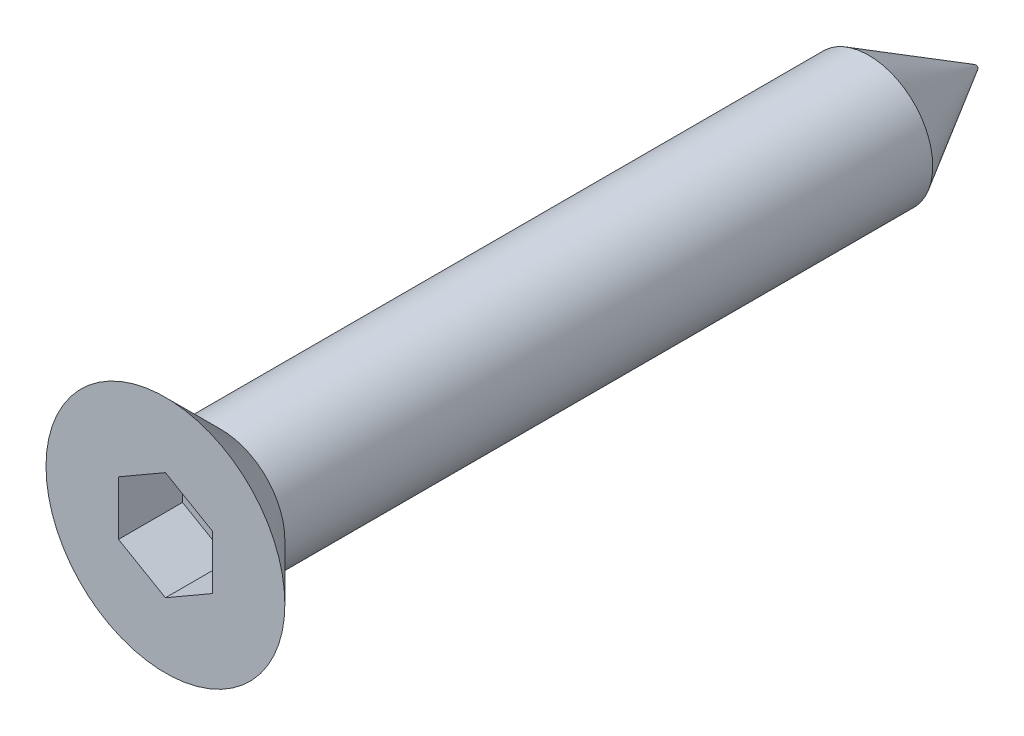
from build123d import *

# Parameters (mm, degrees)
ESQUISSE3_R             = 1.5
EXTRUSION1_DEPTH        = 19
ENL_V_MAT_EXTRU_2_DEPTH = 1.5
CHANFREIN1_SIZE         = 1.45
CHANFREIN1_SIZE2        = 2.511473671


with BuildPart() as part:
    # Esquisse1 → R_volution2 (revolve)
    with BuildSketch(Plane(origin=(0, 0, 0), x_dir=(0, 0, -1), z_dir=(1, 0, 0)), mode=Mode.PRIVATE) as r_volution2_sk:
        Polygon((0, 2.8), (1.3, 1.5), (1.3, 0), (0, 0), align=None)
    revolve(r_volution2_sk.sketch.rotate(Axis((0, 0, 1.603508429), (0, 0, -1)), 90), axis=Axis((0, 0, 1.603508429), (0, 0, -1)))

    # Esquisse3 → Extrusion1 (add)
    with BuildSketch(Plane.XY):
        Circle(ESQUISSE3_R)
    extrude(amount=-EXTRUSION1_DEPTH)

    # Esquisse2 → Enl_v. mat.-Extru.2 (cut)
    with BuildSketch(Plane.XY):
        Polygon((0, 1.270170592), (-1.1, 0.635085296), (-1.1, -0.635085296), (0, -1.270170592), (1.1, -0.635085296), (1.1, 0.635085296), align=None)
    extrude(amount=-ENL_V_MAT_EXTRU_2_DEPTH, mode=Mode.SUBTRACT)

    # Chanfrein1
    chanfrein1_edges = [part.edges().sort_by_distance(p)[0] for p in [
        (-1.5, 0, -19),
    ]]
    chanfrein1_side = [part.faces().sort_by_distance(p)[0] for p in [
        (0, 0, -19),
    ]]
    chamfer(chanfrein1_edges, length=CHANFREIN1_SIZE, length2=CHANFREIN1_SIZE2, reference=chanfrein1_side[0])


solid = part.part
